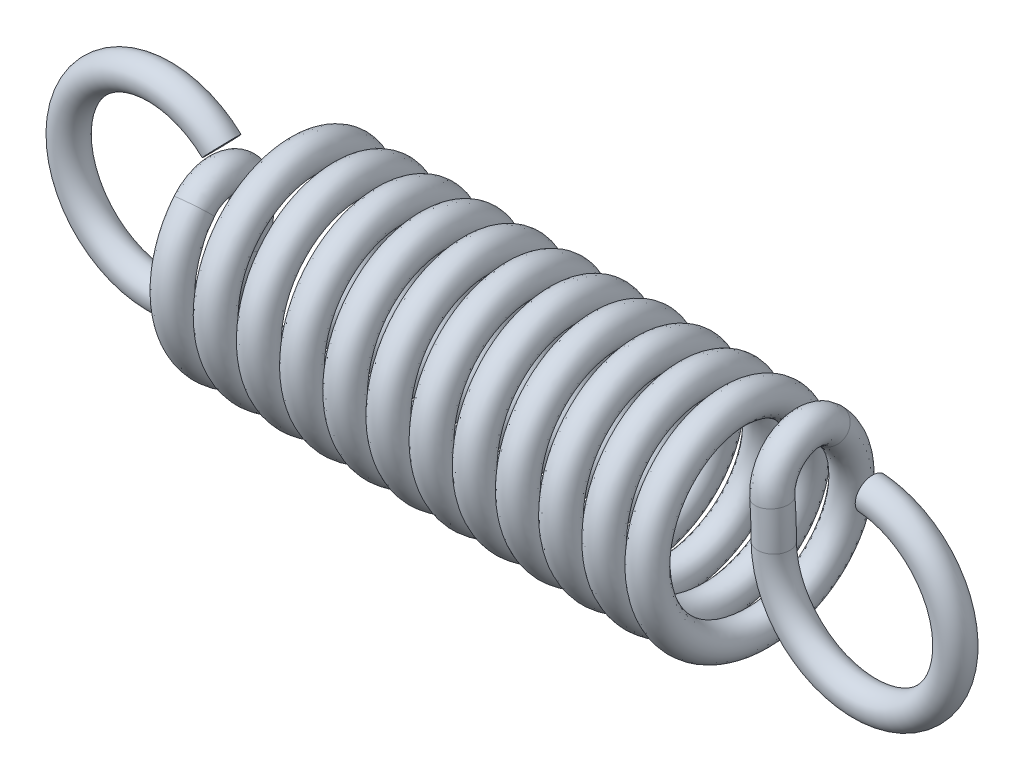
from build123d import *

# Parameters (mm, degrees)
BASE_BALAYAGE_PITCH       = 0.808144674
BASE_BALAYAGE_HEIGHT      = 9.495699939
BASE_BALAYAGE_RADIUS      = 1.700000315
BASE_BALAYAGE_START_ANGLE = -45.000004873
ESQUISSE7_R               = 0.3


with BuildPart() as part:
    # Base-Balayage: sweep along a curve in space
    with BuildLine() as base_balayage_path:
        ThreePointArc((1.977477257, 1.695372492, 0), (3.009045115, -1.245610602, 0), (0.152129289, 0, 0))
        ThreePointArc((0.152129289, 0, 0), (0.145476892, 0.352332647, 0), (0.125529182, 0.704163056, 0))
        add(Edge.make_bspline(
            [(0.125529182, 0.704163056, 0), (0.118599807, 0.79575003, 0), (0.104587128, 0.980918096, -0.036663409), (0.083691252, 1.214969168, -0.193285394), (0.062764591, 1.371694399, -0.42766252), (0.04183793, 1.426602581, -0.70421365), (0.020942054, 1.371851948, -0.980461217), (0.006929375, 1.266843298, -1.137319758), (0, 1.202081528, -1.202081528)],
            knots=[0, 0, 0, 0, 0.166666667, 0.333333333, 0.5, 0.666666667, 0.833333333, 1, 1, 1, 1], degree=3))
        add(Helix(BASE_BALAYAGE_PITCH, BASE_BALAYAGE_HEIGHT, BASE_BALAYAGE_RADIUS, center=(-3e-08, -3.25e-07, 1.2e-07), direction=(-0.9999999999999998, 0, -2.5329909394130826e-08), mode=Mode.PRIVATE).rotate(Axis((-3e-08, -3.25e-07, 1.2e-07), (-0.9999999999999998, 0, -2.5329909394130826e-08)), BASE_BALAYAGE_START_ANGLE))
        add(Edge.make_bspline(
            [(-9.4957, 1.202081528, 1.202081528), (-9.502629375, 1.266843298, 1.137319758), (-9.516642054, 1.371851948, 0.980461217), (-9.53753793, 1.426602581, 0.70421365), (-9.558464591, 1.371694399, 0.42766252), (-9.579391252, 1.214969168, 0.193285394), (-9.600287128, 0.980918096, 0.036663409), (-9.614299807, 0.79575003, 0), (-9.621229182, 0.704163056, 0)],
            knots=[0, 0, 0, 0, 0.166666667, 0.333333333, 0.5, 0.666666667, 0.833333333, 1, 1, 1, 1], degree=3))
        ThreePointArc((-9.621229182, 0.704163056, 0), (-9.641176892, 0.352332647, 0), (-9.647829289, 0, 0))
        ThreePointArc((-9.647829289, 0, 0), (-12.908428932, -0.674187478, 0), (-10.182569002, 1.237807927, 0))
    # Esquisse7 → Base-Balayage (sweep)
    with BuildSketch(Plane(origin=(1.977477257, 1.695372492, 0), x_dir=(0, 0, 1), z_dir=(-0.9972779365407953, 0.07373409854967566, 0))):
        Circle(ESQUISSE7_R)
    sweep(path=base_balayage_path.line, is_frenet=True)


solid = part.part
